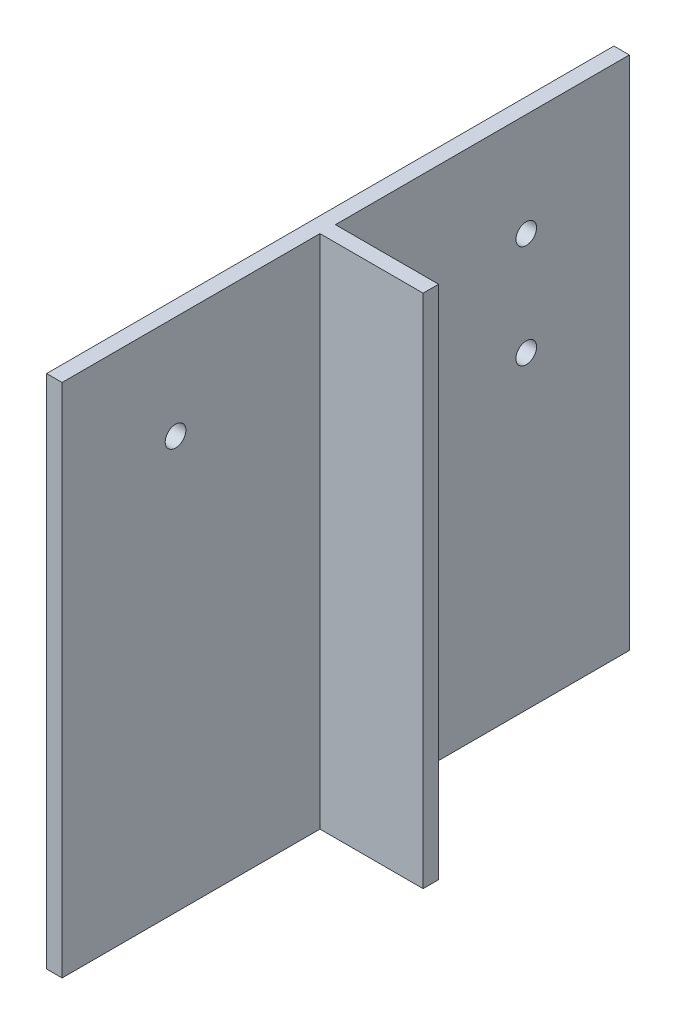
ISO-10303-21;
HEADER;
FILE_DESCRIPTION(('STEP AP214'),'2;1');
FILE_NAME('part.step','',(''),(''),'','','');
FILE_SCHEMA(('AUTOMOTIVE_DESIGN { 1 0 10303 214 1 1 1 1 }'));
ENDSEC;
DATA;
#1=APPLICATION_CONTEXT('core data for automotive mechanical design processes');
#2=APPLICATION_PROTOCOL_DEFINITION('international standard','automotive_design',2000,#1);
#3=PRODUCT_CONTEXT('',#1,'mechanical');
#4=PRODUCT('Part','Part','',(#3));
#5=PRODUCT_RELATED_PRODUCT_CATEGORY('part','',(#4));
#6=PRODUCT_DEFINITION_FORMATION('','',#4);
#7=PRODUCT_DEFINITION_CONTEXT('part definition',#1,'design');
#8=PRODUCT_DEFINITION('design','',#6,#7);
#9=PRODUCT_DEFINITION_SHAPE('','',#8);
#10=(LENGTH_UNIT() NAMED_UNIT(*) SI_UNIT(.MILLI.,.METRE.));
#11=(NAMED_UNIT(*) PLANE_ANGLE_UNIT() SI_UNIT($,.RADIAN.));
#12=(NAMED_UNIT(*) SI_UNIT($,.STERADIAN.) SOLID_ANGLE_UNIT());
#13=UNCERTAINTY_MEASURE_WITH_UNIT(LENGTH_MEASURE(1.E-05),#10,'distance_accuracy_value','');
#14=(GEOMETRIC_REPRESENTATION_CONTEXT(3) GLOBAL_UNCERTAINTY_ASSIGNED_CONTEXT((#13)) GLOBAL_UNIT_ASSIGNED_CONTEXT((#10,
#11,#12)) REPRESENTATION_CONTEXT('',''));
#15=CARTESIAN_POINT('',(0.,0.,0.));
#16=DIRECTION('',(0.,0.,1.));
#17=DIRECTION('',(1.,0.,0.));
#18=AXIS2_PLACEMENT_3D('',#15,#16,#17);
#19=CARTESIAN_POINT('',(30.,1000.,0.));
#20=DIRECTION('',(-1.,0.,0.));
#21=DIRECTION('',(0.,0.,1.));
#22=AXIS2_PLACEMENT_3D('',#19,#20,#21);
#23=PLANE('',#22);
#24=CARTESIAN_POINT('',(30.,800.,-220.));
#25=DIRECTION('',(1.,0.,0.));
#26=DIRECTION('',(0.,0.,-1.));
#27=AXIS2_PLACEMENT_3D('',#24,#25,#26);
#28=CIRCLE('',#27,20.);
#29=CARTESIAN_POINT('',(30.,800.,-240.));
#30=VERTEX_POINT('',#29);
#31=EDGE_CURVE('E120',#30,#30,#28,.T.);
#32=ORIENTED_EDGE('',*,*,#31,.F.);
#33=EDGE_LOOP('',(#32));
#34=FACE_BOUND('',#33,.T.);
#35=DIRECTION('',(0.,-1.,0.));
#36=VECTOR('',#35,1.);
#37=CARTESIAN_POINT('',(30.,1000.,-500.));
#38=LINE('',#37,#36);
#39=CARTESIAN_POINT('',(30.,1000.,-500.));
#40=VERTEX_POINT('',#39);
#41=CARTESIAN_POINT('',(30.,0.,-500.));
#42=VERTEX_POINT('',#41);
#43=EDGE_CURVE('E49',#40,#42,#38,.T.);
#44=ORIENTED_EDGE('',*,*,#43,.F.);
#45=DIRECTION('',(0.,0.,1.));
#46=VECTOR('',#45,1.);
#47=CARTESIAN_POINT('',(30.,1000.,0.));
#48=LINE('',#47,#46);
#49=CARTESIAN_POINT('',(30.,1000.,0.));
#50=VERTEX_POINT('',#49);
#51=EDGE_CURVE('E143',#40,#50,#48,.T.);
#52=ORIENTED_EDGE('',*,*,#51,.T.);
#53=DIRECTION('',(0.,-1.,0.));
#54=VECTOR('',#53,1.);
#55=CARTESIAN_POINT('',(30.,0.,0.));
#56=LINE('',#55,#54);
#57=CARTESIAN_POINT('',(30.,0.,0.));
#58=VERTEX_POINT('',#57);
#59=EDGE_CURVE('E177',#50,#58,#56,.T.);
#60=ORIENTED_EDGE('',*,*,#59,.T.);
#61=DIRECTION('',(0.,0.,-1.));
#62=VECTOR('',#61,1.);
#63=CARTESIAN_POINT('',(30.,0.,0.));
#64=LINE('',#63,#62);
#65=EDGE_CURVE('E162',#58,#42,#64,.T.);
#66=ORIENTED_EDGE('',*,*,#65,.T.);
#67=EDGE_LOOP('',(#44,#52,#60,#66));
#68=FACE_BOUND('',#67,.T.);
#69=ADVANCED_FACE('F32',(#34,#68),#23,.F.);
#70=CARTESIAN_POINT('',(30.,800.,-700.));
#71=DIRECTION('',(1.,0.,0.));
#72=DIRECTION('',(0.,0.,-1.));
#73=AXIS2_PLACEMENT_3D('',#70,#71,#72);
#74=CIRCLE('',#73,20.);
#75=CARTESIAN_POINT('',(30.,800.,-720.));
#76=VERTEX_POINT('',#75);
#77=EDGE_CURVE('E196',#76,#76,#74,.T.);
#78=ORIENTED_EDGE('',*,*,#77,.F.);
#79=EDGE_LOOP('',(#78));
#80=FACE_BOUND('',#79,.T.);
#81=CARTESIAN_POINT('',(30.,600.,-900.));
#82=DIRECTION('',(1.,0.,0.));
#83=DIRECTION('',(0.,0.,-1.));
#84=AXIS2_PLACEMENT_3D('',#81,#82,#83);
#85=CIRCLE('',#84,20.);
#86=CARTESIAN_POINT('',(30.,600.,-920.));
#87=VERTEX_POINT('',#86);
#88=EDGE_CURVE('E204',#87,#87,#85,.T.);
#89=ORIENTED_EDGE('',*,*,#88,.F.);
#90=EDGE_LOOP('',(#89));
#91=FACE_BOUND('',#90,.T.);
#92=CARTESIAN_POINT('',(30.,800.,-900.));
#93=DIRECTION('',(1.,0.,0.));
#94=DIRECTION('',(0.,0.,-1.));
#95=AXIS2_PLACEMENT_3D('',#92,#93,#94);
#96=CIRCLE('',#95,20.);
#97=CARTESIAN_POINT('',(30.,800.,-920.));
#98=VERTEX_POINT('',#97);
#99=EDGE_CURVE('E360',#98,#98,#96,.T.);
#100=ORIENTED_EDGE('',*,*,#99,.F.);
#101=EDGE_LOOP('',(#100));
#102=FACE_BOUND('',#101,.T.);
#103=CARTESIAN_POINT('',(30.,600.,-700.));
#104=DIRECTION('',(1.,0.,0.));
#105=DIRECTION('',(0.,0.,-1.));
#106=AXIS2_PLACEMENT_3D('',#103,#104,#105);
#107=CIRCLE('',#106,20.);
#108=CARTESIAN_POINT('',(30.,600.,-720.));
#109=VERTEX_POINT('',#108);
#110=EDGE_CURVE('E353',#109,#109,#107,.T.);
#111=ORIENTED_EDGE('',*,*,#110,.F.);
#112=EDGE_LOOP('',(#111));
#113=FACE_BOUND('',#112,.T.);
#114=DIRECTION('',(0.,1.,0.));
#115=VECTOR('',#114,1.);
#116=CARTESIAN_POINT('',(30.,1000.,-530.));
#117=LINE('',#116,#115);
#118=CARTESIAN_POINT('',(30.,0.,-530.));
#119=VERTEX_POINT('',#118);
#120=CARTESIAN_POINT('',(30.,1000.,-530.));
#121=VERTEX_POINT('',#120);
#122=EDGE_CURVE('E57',#119,#121,#117,.T.);
#123=ORIENTED_EDGE('',*,*,#122,.F.);
#124=CARTESIAN_POINT('',(30.,0.,-1100.));
#125=VERTEX_POINT('',#124);
#126=EDGE_CURVE('E166',#119,#125,#64,.T.);
#127=ORIENTED_EDGE('',*,*,#126,.T.);
#128=DIRECTION('',(0.,1.,0.));
#129=VECTOR('',#128,1.);
#130=CARTESIAN_POINT('',(30.,0.,-1100.));
#131=LINE('',#130,#129);
#132=CARTESIAN_POINT('',(30.,1000.,-1100.));
#133=VERTEX_POINT('',#132);
#134=EDGE_CURVE('E161',#125,#133,#131,.T.);
#135=ORIENTED_EDGE('',*,*,#134,.T.);
#136=EDGE_CURVE('E160',#133,#121,#48,.T.);
#137=ORIENTED_EDGE('',*,*,#136,.T.);
#138=EDGE_LOOP('',(#123,#127,#135,#137));
#139=FACE_BOUND('',#138,.T.);
#140=ADVANCED_FACE('F207',(#80,#91,#102,#113,#139),#23,.F.);
#141=CARTESIAN_POINT('',(30.,0.,0.));
#142=DIRECTION('',(0.,0.,-1.));
#143=DIRECTION('',(-1.,0.,0.));
#144=AXIS2_PLACEMENT_3D('',#141,#142,#143);
#145=PLANE('',#144);
#146=DIRECTION('',(0.,-1.,0.));
#147=VECTOR('',#146,1.);
#148=CARTESIAN_POINT('',(0.,0.,0.));
#149=LINE('',#148,#147);
#150=CARTESIAN_POINT('',(0.,1000.,0.));
#151=VERTEX_POINT('',#150);
#152=CARTESIAN_POINT('',(0.,0.,0.));
#153=VERTEX_POINT('',#152);
#154=EDGE_CURVE('E173',#151,#153,#149,.T.);
#155=ORIENTED_EDGE('',*,*,#154,.T.);
#156=DIRECTION('',(-1.,0.,0.));
#157=VECTOR('',#156,1.);
#158=CARTESIAN_POINT('',(30.,0.,0.));
#159=LINE('',#158,#157);
#160=EDGE_CURVE('E11',#58,#153,#159,.T.);
#161=ORIENTED_EDGE('',*,*,#160,.F.);
#162=ORIENTED_EDGE('',*,*,#59,.F.);
#163=DIRECTION('',(-1.,0.,0.));
#164=VECTOR('',#163,1.);
#165=CARTESIAN_POINT('',(30.,1000.,0.));
#166=LINE('',#165,#164);
#167=EDGE_CURVE('E157',#50,#151,#166,.T.);
#168=ORIENTED_EDGE('',*,*,#167,.T.);
#169=EDGE_LOOP('',(#155,#161,#162,#168));
#170=FACE_BOUND('',#169,.T.);
#171=ADVANCED_FACE('F34',(#170),#145,.F.);
#172=CARTESIAN_POINT('',(30.,0.,0.));
#173=DIRECTION('',(0.,1.,0.));
#174=DIRECTION('',(0.,0.,1.));
#175=AXIS2_PLACEMENT_3D('',#172,#173,#174);
#176=PLANE('',#175);
#177=DIRECTION('',(0.,0.,-1.));
#178=VECTOR('',#177,1.);
#179=CARTESIAN_POINT('',(0.,0.,0.));
#180=LINE('',#179,#178);
#181=CARTESIAN_POINT('',(0.,0.,-1100.));
#182=VERTEX_POINT('',#181);
#183=EDGE_CURVE('E188',#153,#182,#180,.T.);
#184=ORIENTED_EDGE('',*,*,#183,.T.);
#185=DIRECTION('',(-1.,0.,0.));
#186=VECTOR('',#185,1.);
#187=CARTESIAN_POINT('',(30.,0.,-1100.));
#188=LINE('',#187,#186);
#189=EDGE_CURVE('E41',#125,#182,#188,.T.);
#190=ORIENTED_EDGE('',*,*,#189,.F.);
#191=ORIENTED_EDGE('',*,*,#126,.F.);
#192=DIRECTION('',(-1.,0.,0.));
#193=VECTOR('',#192,1.);
#194=CARTESIAN_POINT('',(230.,0.,-530.));
#195=LINE('',#194,#193);
#196=CARTESIAN_POINT('',(230.,0.,-530.));
#197=VERTEX_POINT('',#196);
#198=EDGE_CURVE('E105',#197,#119,#195,.T.);
#199=ORIENTED_EDGE('',*,*,#198,.F.);
#200=DIRECTION('',(0.,0.,-1.));
#201=VECTOR('',#200,1.);
#202=CARTESIAN_POINT('',(230.,0.,-500.));
#203=LINE('',#202,#201);
#204=CARTESIAN_POINT('',(230.,0.,-500.));
#205=VERTEX_POINT('',#204);
#206=EDGE_CURVE('E99',#205,#197,#203,.T.);
#207=ORIENTED_EDGE('',*,*,#206,.F.);
#208=DIRECTION('',(-1.,0.,0.));
#209=VECTOR('',#208,1.);
#210=CARTESIAN_POINT('',(230.,0.,-500.));
#211=LINE('',#210,#209);
#212=EDGE_CURVE('E103',#205,#42,#211,.T.);
#213=ORIENTED_EDGE('',*,*,#212,.T.);
#214=ORIENTED_EDGE('',*,*,#65,.F.);
#215=ORIENTED_EDGE('',*,*,#160,.T.);
#216=EDGE_LOOP('',(#184,#190,#191,#199,#207,#213,#214,#215));
#217=FACE_BOUND('',#216,.T.);
#218=ADVANCED_FACE('F101',(#217),#176,.F.);
#219=CARTESIAN_POINT('',(30.,0.,-1100.));
#220=DIRECTION('',(0.,0.,1.));
#221=DIRECTION('',(1.,0.,0.));
#222=AXIS2_PLACEMENT_3D('',#219,#220,#221);
#223=PLANE('',#222);
#224=DIRECTION('',(0.,1.,0.));
#225=VECTOR('',#224,1.);
#226=CARTESIAN_POINT('',(0.,0.,-1100.));
#227=LINE('',#226,#225);
#228=CARTESIAN_POINT('',(0.,1000.,-1100.));
#229=VERTEX_POINT('',#228);
#230=EDGE_CURVE('E187',#182,#229,#227,.T.);
#231=ORIENTED_EDGE('',*,*,#230,.T.);
#232=DIRECTION('',(-1.,0.,0.));
#233=VECTOR('',#232,1.);
#234=CARTESIAN_POINT('',(30.,1000.,-1100.));
#235=LINE('',#234,#233);
#236=EDGE_CURVE('E181',#133,#229,#235,.T.);
#237=ORIENTED_EDGE('',*,*,#236,.F.);
#238=ORIENTED_EDGE('',*,*,#134,.F.);
#239=ORIENTED_EDGE('',*,*,#189,.T.);
#240=EDGE_LOOP('',(#231,#237,#238,#239));
#241=FACE_BOUND('',#240,.T.);
#242=ADVANCED_FACE('F212',(#241),#223,.F.);
#243=CARTESIAN_POINT('',(30.,1000.,0.));
#244=DIRECTION('',(0.,-1.,0.));
#245=DIRECTION('',(0.,0.,-1.));
#246=AXIS2_PLACEMENT_3D('',#243,#244,#245);
#247=PLANE('',#246);
#248=DIRECTION('',(0.,0.,1.));
#249=VECTOR('',#248,1.);
#250=CARTESIAN_POINT('',(0.,1000.,0.));
#251=LINE('',#250,#249);
#252=EDGE_CURVE('E185',#229,#151,#251,.T.);
#253=ORIENTED_EDGE('',*,*,#252,.T.);
#254=ORIENTED_EDGE('',*,*,#167,.F.);
#255=ORIENTED_EDGE('',*,*,#51,.F.);
#256=DIRECTION('',(-1.,0.,0.));
#257=VECTOR('',#256,1.);
#258=CARTESIAN_POINT('',(230.,1000.,-500.));
#259=LINE('',#258,#257);
#260=CARTESIAN_POINT('',(230.,1000.,-500.));
#261=VERTEX_POINT('',#260);
#262=EDGE_CURVE('E133',#261,#40,#259,.T.);
#263=ORIENTED_EDGE('',*,*,#262,.F.);
#264=DIRECTION('',(0.,0.,1.));
#265=VECTOR('',#264,1.);
#266=CARTESIAN_POINT('',(230.,1000.,-500.));
#267=LINE('',#266,#265);
#268=CARTESIAN_POINT('',(230.,1000.,-530.));
#269=VERTEX_POINT('',#268);
#270=EDGE_CURVE('E114',#269,#261,#267,.T.);
#271=ORIENTED_EDGE('',*,*,#270,.F.);
#272=DIRECTION('',(-1.,0.,0.));
#273=VECTOR('',#272,1.);
#274=CARTESIAN_POINT('',(230.,1000.,-530.));
#275=LINE('',#274,#273);
#276=EDGE_CURVE('E125',#269,#121,#275,.T.);
#277=ORIENTED_EDGE('',*,*,#276,.T.);
#278=ORIENTED_EDGE('',*,*,#136,.F.);
#279=ORIENTED_EDGE('',*,*,#236,.T.);
#280=EDGE_LOOP('',(#253,#254,#255,#263,#271,#277,#278,#279));
#281=FACE_BOUND('',#280,.T.);
#282=ADVANCED_FACE('F154',(#281),#247,.F.);
#283=CARTESIAN_POINT('',(0.,1000.,0.));
#284=DIRECTION('',(-1.,0.,0.));
#285=DIRECTION('',(0.,0.,1.));
#286=AXIS2_PLACEMENT_3D('',#283,#284,#285);
#287=PLANE('',#286);
#288=CARTESIAN_POINT('',(0.,800.,-220.));
#289=DIRECTION('',(1.,0.,0.));
#290=DIRECTION('',(0.,0.,-1.));
#291=AXIS2_PLACEMENT_3D('',#288,#289,#290);
#292=CIRCLE('',#291,20.);
#293=CARTESIAN_POINT('',(0.,800.,-240.));
#294=VERTEX_POINT('',#293);
#295=EDGE_CURVE('E123',#294,#294,#292,.T.);
#296=ORIENTED_EDGE('',*,*,#295,.T.);
#297=EDGE_LOOP('',(#296));
#298=FACE_BOUND('',#297,.T.);
#299=CARTESIAN_POINT('',(0.,600.,-700.));
#300=DIRECTION('',(1.,0.,0.));
#301=DIRECTION('',(0.,0.,-1.));
#302=AXIS2_PLACEMENT_3D('',#299,#300,#301);
#303=CIRCLE('',#302,20.);
#304=CARTESIAN_POINT('',(0.,600.,-720.));
#305=VERTEX_POINT('',#304);
#306=EDGE_CURVE('E355',#305,#305,#303,.T.);
#307=ORIENTED_EDGE('',*,*,#306,.T.);
#308=EDGE_LOOP('',(#307));
#309=FACE_BOUND('',#308,.T.);
#310=CARTESIAN_POINT('',(0.,800.,-900.));
#311=DIRECTION('',(1.,0.,0.));
#312=DIRECTION('',(0.,0.,-1.));
#313=AXIS2_PLACEMENT_3D('',#310,#311,#312);
#314=CIRCLE('',#313,20.);
#315=CARTESIAN_POINT('',(0.,800.,-920.));
#316=VERTEX_POINT('',#315);
#317=EDGE_CURVE('E363',#316,#316,#314,.T.);
#318=ORIENTED_EDGE('',*,*,#317,.T.);
#319=EDGE_LOOP('',(#318));
#320=FACE_BOUND('',#319,.T.);
#321=CARTESIAN_POINT('',(0.,600.,-900.));
#322=DIRECTION('',(1.,0.,0.));
#323=DIRECTION('',(0.,0.,-1.));
#324=AXIS2_PLACEMENT_3D('',#321,#322,#323);
#325=CIRCLE('',#324,20.);
#326=CARTESIAN_POINT('',(0.,600.,-920.));
#327=VERTEX_POINT('',#326);
#328=EDGE_CURVE('E201',#327,#327,#325,.T.);
#329=ORIENTED_EDGE('',*,*,#328,.T.);
#330=EDGE_LOOP('',(#329));
#331=FACE_BOUND('',#330,.T.);
#332=CARTESIAN_POINT('',(0.,800.,-700.));
#333=DIRECTION('',(1.,0.,0.));
#334=DIRECTION('',(0.,0.,-1.));
#335=AXIS2_PLACEMENT_3D('',#332,#333,#334);
#336=CIRCLE('',#335,20.);
#337=CARTESIAN_POINT('',(0.,800.,-720.));
#338=VERTEX_POINT('',#337);
#339=EDGE_CURVE('E191',#338,#338,#336,.T.);
#340=ORIENTED_EDGE('',*,*,#339,.T.);
#341=EDGE_LOOP('',(#340));
#342=FACE_BOUND('',#341,.T.);
#343=ORIENTED_EDGE('',*,*,#154,.F.);
#344=ORIENTED_EDGE('',*,*,#252,.F.);
#345=ORIENTED_EDGE('',*,*,#230,.F.);
#346=ORIENTED_EDGE('',*,*,#183,.F.);
#347=EDGE_LOOP('',(#343,#344,#345,#346));
#348=FACE_BOUND('',#347,.T.);
#349=ADVANCED_FACE('F224',(#298,#309,#320,#331,#342,#348),#287,.T.);
#350=CARTESIAN_POINT('',(0.,800.,-700.));
#351=DIRECTION('',(1.,0.,0.));
#352=DIRECTION('',(0.,0.,-1.));
#353=AXIS2_PLACEMENT_3D('',#350,#351,#352);
#354=CYLINDRICAL_SURFACE('',#353,20.);
#355=ORIENTED_EDGE('',*,*,#339,.F.);
#356=EDGE_LOOP('',(#355));
#357=FACE_BOUND('',#356,.T.);
#358=ORIENTED_EDGE('',*,*,#77,.T.);
#359=EDGE_LOOP('',(#358));
#360=FACE_BOUND('',#359,.T.);
#361=ADVANCED_FACE('F222',(#357,#360),#354,.F.);
#362=CARTESIAN_POINT('',(0.,600.,-900.));
#363=DIRECTION('',(1.,0.,0.));
#364=DIRECTION('',(0.,0.,-1.));
#365=AXIS2_PLACEMENT_3D('',#362,#363,#364);
#366=CYLINDRICAL_SURFACE('',#365,20.);
#367=ORIENTED_EDGE('',*,*,#328,.F.);
#368=EDGE_LOOP('',(#367));
#369=FACE_BOUND('',#368,.T.);
#370=ORIENTED_EDGE('',*,*,#88,.T.);
#371=EDGE_LOOP('',(#370));
#372=FACE_BOUND('',#371,.T.);
#373=ADVANCED_FACE('F256',(#369,#372),#366,.F.);
#374=CARTESIAN_POINT('',(0.,800.,-900.));
#375=DIRECTION('',(1.,0.,0.));
#376=DIRECTION('',(0.,0.,-1.));
#377=AXIS2_PLACEMENT_3D('',#374,#375,#376);
#378=CYLINDRICAL_SURFACE('',#377,20.);
#379=ORIENTED_EDGE('',*,*,#317,.F.);
#380=EDGE_LOOP('',(#379));
#381=FACE_BOUND('',#380,.T.);
#382=ORIENTED_EDGE('',*,*,#99,.T.);
#383=EDGE_LOOP('',(#382));
#384=FACE_BOUND('',#383,.T.);
#385=ADVANCED_FACE('F263',(#381,#384),#378,.F.);
#386=CARTESIAN_POINT('',(0.,600.,-700.));
#387=DIRECTION('',(1.,0.,0.));
#388=DIRECTION('',(0.,0.,-1.));
#389=AXIS2_PLACEMENT_3D('',#386,#387,#388);
#390=CYLINDRICAL_SURFACE('',#389,20.);
#391=ORIENTED_EDGE('',*,*,#306,.F.);
#392=EDGE_LOOP('',(#391));
#393=FACE_BOUND('',#392,.T.);
#394=ORIENTED_EDGE('',*,*,#110,.T.);
#395=EDGE_LOOP('',(#394));
#396=FACE_BOUND('',#395,.T.);
#397=ADVANCED_FACE('F270',(#393,#396),#390,.F.);
#398=CARTESIAN_POINT('',(0.,800.,-220.));
#399=DIRECTION('',(1.,0.,0.));
#400=DIRECTION('',(0.,0.,-1.));
#401=AXIS2_PLACEMENT_3D('',#398,#399,#400);
#402=CYLINDRICAL_SURFACE('',#401,20.);
#403=ORIENTED_EDGE('',*,*,#295,.F.);
#404=EDGE_LOOP('',(#403));
#405=FACE_BOUND('',#404,.T.);
#406=ORIENTED_EDGE('',*,*,#31,.T.);
#407=EDGE_LOOP('',(#406));
#408=FACE_BOUND('',#407,.T.);
#409=ADVANCED_FACE('F277',(#405,#408),#402,.F.);
#410=CARTESIAN_POINT('',(230.,1000.,-500.));
#411=DIRECTION('',(0.,0.,-1.));
#412=DIRECTION('',(0.,1.,0.));
#413=AXIS2_PLACEMENT_3D('',#410,#411,#412);
#414=PLANE('',#413);
#415=ORIENTED_EDGE('',*,*,#43,.T.);
#416=ORIENTED_EDGE('',*,*,#212,.F.);
#417=DIRECTION('',(0.,-1.,0.));
#418=VECTOR('',#417,1.);
#419=CARTESIAN_POINT('',(230.,1000.,-500.));
#420=LINE('',#419,#418);
#421=EDGE_CURVE('E109',#261,#205,#420,.T.);
#422=ORIENTED_EDGE('',*,*,#421,.F.);
#423=ORIENTED_EDGE('',*,*,#262,.T.);
#424=EDGE_LOOP('',(#415,#416,#422,#423));
#425=FACE_BOUND('',#424,.T.);
#426=ADVANCED_FACE('F119',(#425),#414,.F.);
#427=CARTESIAN_POINT('',(230.,1000.,-530.));
#428=DIRECTION('',(0.,0.,1.));
#429=DIRECTION('',(0.,-1.,0.));
#430=AXIS2_PLACEMENT_3D('',#427,#428,#429);
#431=PLANE('',#430);
#432=ORIENTED_EDGE('',*,*,#122,.T.);
#433=ORIENTED_EDGE('',*,*,#276,.F.);
#434=DIRECTION('',(0.,1.,0.));
#435=VECTOR('',#434,1.);
#436=CARTESIAN_POINT('',(230.,1000.,-530.));
#437=LINE('',#436,#435);
#438=EDGE_CURVE('E108',#197,#269,#437,.T.);
#439=ORIENTED_EDGE('',*,*,#438,.F.);
#440=ORIENTED_EDGE('',*,*,#198,.T.);
#441=EDGE_LOOP('',(#432,#433,#439,#440));
#442=FACE_BOUND('',#441,.T.);
#443=ADVANCED_FACE('F153',(#442),#431,.F.);
#444=CARTESIAN_POINT('',(230.,0.,-500.));
#445=DIRECTION('',(1.,0.,0.));
#446=DIRECTION('',(0.,0.,-1.));
#447=AXIS2_PLACEMENT_3D('',#444,#445,#446);
#448=PLANE('',#447);
#449=ORIENTED_EDGE('',*,*,#421,.T.);
#450=ORIENTED_EDGE('',*,*,#206,.T.);
#451=ORIENTED_EDGE('',*,*,#438,.T.);
#452=ORIENTED_EDGE('',*,*,#270,.T.);
#453=EDGE_LOOP('',(#449,#450,#451,#452));
#454=FACE_BOUND('',#453,.T.);
#455=ADVANCED_FACE('F112',(#454),#448,.T.);
#456=CLOSED_SHELL('',(#69,#140,#171,#218,#242,#282,#349,#361,#373,#385,#397,#409,#426,#443,#455));
#457=MANIFOLD_SOLID_BREP('B2',#456);
#458=ADVANCED_BREP_SHAPE_REPRESENTATION('',(#18,#457),#14);
#459=SHAPE_DEFINITION_REPRESENTATION(#9,#458);
ENDSEC;
END-ISO-10303-21;
